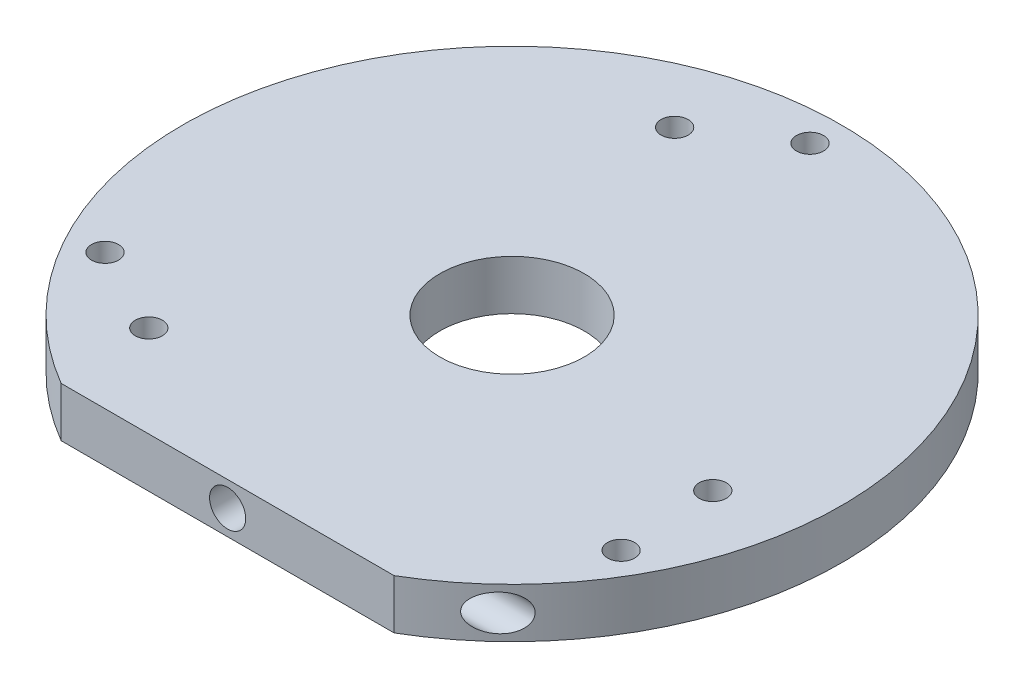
ISO-10303-21;
HEADER;
FILE_DESCRIPTION(('STEP AP214'),'2;1');
FILE_NAME('part.step','',(''),(''),'','','');
FILE_SCHEMA(('AUTOMOTIVE_DESIGN { 1 0 10303 214 1 1 1 1 }'));
ENDSEC;
DATA;
#1=APPLICATION_CONTEXT('core data for automotive mechanical design processes');
#2=APPLICATION_PROTOCOL_DEFINITION('international standard','automotive_design',2000,#1);
#3=PRODUCT_CONTEXT('',#1,'mechanical');
#4=PRODUCT('Part','Part','',(#3));
#5=PRODUCT_RELATED_PRODUCT_CATEGORY('part','',(#4));
#6=PRODUCT_DEFINITION_FORMATION('','',#4);
#7=PRODUCT_DEFINITION_CONTEXT('part definition',#1,'design');
#8=PRODUCT_DEFINITION('design','',#6,#7);
#9=PRODUCT_DEFINITION_SHAPE('','',#8);
#10=(LENGTH_UNIT() NAMED_UNIT(*) SI_UNIT(.MILLI.,.METRE.));
#11=(NAMED_UNIT(*) PLANE_ANGLE_UNIT() SI_UNIT($,.RADIAN.));
#12=(NAMED_UNIT(*) SI_UNIT($,.STERADIAN.) SOLID_ANGLE_UNIT());
#13=UNCERTAINTY_MEASURE_WITH_UNIT(LENGTH_MEASURE(1.E-05),#10,'distance_accuracy_value','');
#14=(GEOMETRIC_REPRESENTATION_CONTEXT(3) GLOBAL_UNCERTAINTY_ASSIGNED_CONTEXT((#13)) GLOBAL_UNIT_ASSIGNED_CONTEXT((#10,
#11,#12)) REPRESENTATION_CONTEXT('',''));
#15=CARTESIAN_POINT('',(0.,0.,0.));
#16=DIRECTION('',(0.,0.,1.));
#17=DIRECTION('',(1.,0.,0.));
#18=AXIS2_PLACEMENT_3D('',#15,#16,#17);
#19=CARTESIAN_POINT('',(36.501,-4.74999999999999,26.5));
#20=DIRECTION('',(-1.,0.,0.));
#21=DIRECTION('',(0.,0.,1.));
#22=AXIS2_PLACEMENT_3D('',#19,#20,#21);
#23=CYLINDRICAL_SURFACE('',#22,2.);
#24=CARTESIAN_POINT('',(22.8035085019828,-4.74999999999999,28.5));
#25=CARTESIAN_POINT('',(22.8035194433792,-4.66614474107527,28.4999917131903));
#26=CARTESIAN_POINT('',(22.8101869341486,-4.58214146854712,28.4946603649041));
#27=CARTESIAN_POINT('',(22.836100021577,-4.41730327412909,28.4738966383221));
#28=CARTESIAN_POINT('',(22.8553814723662,-4.33647808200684,28.4584354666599));
#29=CARTESIAN_POINT('',(22.9042916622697,-4.1812608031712,28.4190848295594));
#30=CARTESIAN_POINT('',(22.9338120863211,-4.10681116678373,28.3952835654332));
#31=CARTESIAN_POINT('',(23.0010219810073,-3.96449597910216,28.3408690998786));
#32=CARTESIAN_POINT('',(23.0387126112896,-3.89663136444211,28.3102549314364));
#33=CARTESIAN_POINT('',(23.1425383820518,-3.73255945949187,28.2255110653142));
#34=CARTESIAN_POINT('',(23.2129906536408,-3.64102699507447,28.1676508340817));
#35=CARTESIAN_POINT('',(23.3634974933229,-3.47316212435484,28.0429420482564));
#36=CARTESIAN_POINT('',(23.443578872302,-3.3968738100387,27.9760683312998));
#37=CARTESIAN_POINT('',(23.5892914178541,-3.27545746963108,27.8532234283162));
#38=CARTESIAN_POINT('',(23.6536059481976,-3.22728716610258,27.798639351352));
#39=CARTESIAN_POINT('',(23.784763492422,-3.13837657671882,27.6865037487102));
#40=CARTESIAN_POINT('',(23.8516077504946,-3.09764000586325,27.6289507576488));
#41=CARTESIAN_POINT('',(24.0548205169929,-2.98595285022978,27.4526435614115));
#42=CARTESIAN_POINT('',(24.1938826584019,-2.92551392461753,27.3302296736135));
#43=CARTESIAN_POINT('',(24.4802446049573,-2.82909849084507,27.0740844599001));
#44=CARTESIAN_POINT('',(24.627655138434,-2.79415684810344,26.9400986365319));
#45=CARTESIAN_POINT('',(24.9223768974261,-2.75228770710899,26.6676836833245));
#46=CARTESIAN_POINT('',(25.0696881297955,-2.74535802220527,26.5292549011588));
#47=CARTESIAN_POINT('',(25.3613275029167,-2.76070477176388,26.2505960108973));
#48=CARTESIAN_POINT('',(25.5056535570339,-2.78300097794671,26.1103647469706));
#49=CARTESIAN_POINT('',(25.7877267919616,-2.85940936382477,25.8318062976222));
#50=CARTESIAN_POINT('',(25.9254811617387,-2.91348587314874,25.6934771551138));
#51=CARTESIAN_POINT('',(26.1515970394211,-3.03641799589,25.462956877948));
#52=CARTESIAN_POINT('',(26.2427926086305,-3.09658550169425,25.3689125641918));
#53=CARTESIAN_POINT('',(26.4167638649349,-3.23641911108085,25.1877003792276));
#54=CARTESIAN_POINT('',(26.4995516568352,-3.31605660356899,25.1005226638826));
#55=CARTESIAN_POINT('',(26.6355340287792,-3.47522142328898,24.9560782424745));
#56=CARTESIAN_POINT('',(26.6911622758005,-3.55059027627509,24.8965356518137));
#57=CARTESIAN_POINT('',(26.7931403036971,-3.71346703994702,24.7867550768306));
#58=CARTESIAN_POINT('',(26.8395013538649,-3.80095998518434,24.7365057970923));
#59=CARTESIAN_POINT('',(26.9134018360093,-3.9708233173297,24.656059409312));
#60=CARTESIAN_POINT('',(26.9428120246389,-4.05144151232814,24.6238951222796));
#61=CARTESIAN_POINT('',(26.9921293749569,-4.21882955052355,24.5698249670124));
#62=CARTESIAN_POINT('',(27.0120416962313,-4.30559602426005,24.5479135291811));
#63=CARTESIAN_POINT('',(27.0412231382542,-4.48350719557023,24.5157651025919));
#64=CARTESIAN_POINT('',(27.0504384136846,-4.57467165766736,24.5055871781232));
#65=CARTESIAN_POINT('',(27.057386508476,-4.75796714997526,24.4979155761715));
#66=CARTESIAN_POINT('',(27.055122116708,-4.85009793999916,24.5004188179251));
#67=CARTESIAN_POINT('',(27.0399634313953,-5.02443145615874,24.5171466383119));
#68=CARTESIAN_POINT('',(27.0279828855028,-5.10681559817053,24.5303636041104));
#69=CARTESIAN_POINT('',(26.9952458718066,-5.26761622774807,24.5663853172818));
#70=CARTESIAN_POINT('',(26.9744886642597,-5.34603238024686,24.5891908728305));
#71=CARTESIAN_POINT('',(26.9241028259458,-5.50074948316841,24.6443529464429));
#72=CARTESIAN_POINT('',(26.8941150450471,-5.57679386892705,24.6770951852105));
#73=CARTESIAN_POINT('',(26.8269802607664,-5.72176054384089,24.7500625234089));
#74=CARTESIAN_POINT('',(26.7898292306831,-5.79067879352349,24.7902918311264));
#75=CARTESIAN_POINT('',(26.6904944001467,-5.95192247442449,24.8972894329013));
#76=CARTESIAN_POINT('',(26.6248128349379,-6.03977326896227,24.9675749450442));
#77=CARTESIAN_POINT('',(26.483957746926,-6.1988282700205,25.116938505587));
#78=CARTESIAN_POINT('',(26.4087637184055,-6.26999553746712,25.1960355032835));
#79=CARTESIAN_POINT('',(26.2230230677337,-6.41932603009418,25.3895022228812));
#80=CARTESIAN_POINT('',(26.1095309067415,-6.49069954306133,25.5062773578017));
#81=CARTESIAN_POINT('',(25.8744931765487,-6.60664263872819,25.7446859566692));
#82=CARTESIAN_POINT('',(25.7529376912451,-6.65117851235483,25.8663253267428));
#83=CARTESIAN_POINT('',(25.4683772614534,-6.72538219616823,26.1469362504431));
#84=CARTESIAN_POINT('',(25.3036716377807,-6.74685849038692,26.3063937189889));
#85=CARTESIAN_POINT('',(25.054260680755,-6.75109382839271,26.5433116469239));
#86=CARTESIAN_POINT('',(24.9706118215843,-6.74781793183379,26.6220157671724));
#87=CARTESIAN_POINT('',(24.8030436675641,-6.73210996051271,26.7782016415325));
#88=CARTESIAN_POINT('',(24.7191245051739,-6.71968184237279,26.8556839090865));
#89=CARTESIAN_POINT('',(24.5506433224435,-6.68556392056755,27.0097965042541));
#90=CARTESIAN_POINT('',(24.4660845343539,-6.66377263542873,27.0864077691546));
#91=CARTESIAN_POINT('',(24.2978650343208,-6.61081415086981,27.2374104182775));
#92=CARTESIAN_POINT('',(24.2142045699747,-6.57964443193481,27.3118012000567));
#93=CARTESIAN_POINT('',(24.0487721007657,-6.50773501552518,27.4575796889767));
#94=CARTESIAN_POINT('',(23.9669959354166,-6.46701918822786,27.5289743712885));
#95=CARTESIAN_POINT('',(23.8061573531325,-6.37551184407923,27.6681797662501));
#96=CARTESIAN_POINT('',(23.7270928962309,-6.32472810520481,27.7359931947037));
#97=CARTESIAN_POINT('',(23.5660096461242,-6.20728499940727,27.8730216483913));
#98=CARTESIAN_POINT('',(23.4843634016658,-6.13960936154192,27.9418154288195));
#99=CARTESIAN_POINT('',(23.3284027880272,-5.99021576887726,28.0721553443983));
#100=CARTESIAN_POINT('',(23.2540791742,-5.90851588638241,28.1337106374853));
#101=CARTESIAN_POINT('',(23.1324306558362,-5.7503510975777,28.2337631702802));
#102=CARTESIAN_POINT('',(23.0828195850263,-5.67696692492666,28.2743134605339));
#103=CARTESIAN_POINT('',(22.9929649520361,-5.52096081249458,28.3474321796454));
#104=CARTESIAN_POINT('',(22.9527095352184,-5.43835076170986,28.3800107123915));
#105=CARTESIAN_POINT('',(22.8923772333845,-5.28403428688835,28.4286867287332));
#106=CARTESIAN_POINT('',(22.8698066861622,-5.21395637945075,28.4468356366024));
#107=CARTESIAN_POINT('',(22.8340060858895,-5.07003923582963,28.4755808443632));
#108=CARTESIAN_POINT('',(22.8207512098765,-4.99621056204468,28.4861972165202));
#109=CARTESIAN_POINT('',(22.8096595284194,-4.89312844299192,28.4950775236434));
#110=CARTESIAN_POINT('',(22.807358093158,-4.86459020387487,28.4969195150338));
#111=CARTESIAN_POINT('',(22.8042805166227,-4.80737377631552,28.4993823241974));
#112=CARTESIAN_POINT('',(22.8035047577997,-4.77869555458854,28.5000028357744));
#113=CARTESIAN_POINT('',(22.8035085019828,-4.74999999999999,28.5));
#114=B_SPLINE_CURVE_WITH_KNOTS('',3,(#24,#25,#26,#27,#28,#29,#30,#31,#32,#33,#34,#35,#36,#37,
#38,#39,#40,#41,#42,#43,#44,#45,#46,#47,#48,#49,#50,#51,#52,#53,#54,#55,#56,#57,#58,#59,#60,#61,
#62,#63,#64,#65,#66,#67,#68,#69,#70,#71,#72,#73,#74,#75,#76,#77,#78,#79,#80,#81,#82,#83,#84,#85,
#86,#87,#88,#89,#90,#91,#92,#93,#94,#95,#96,#97,#98,#99,#100,#101,#102,#103,#104,#105,#106,#107,
#108,#109,#110,#111,#112,#113),.UNSPECIFIED.,.T.,.F.,(4,2,2,2,2,2,2,2,2,2,2,2,2,2,2,2,2,2,2,2,2,
2,2,2,2,2,2,2,2,2,2,2,2,2,2,2,2,2,2,2,2,2,2,2,4),(0.,0.251419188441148,0.503556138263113,
0.753103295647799,1.0026858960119,1.3880944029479,1.77460201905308,2.06563988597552,
2.35682280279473,2.93912672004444,3.54391885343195,4.14866377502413,4.75381802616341,
5.35829434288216,5.78938786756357,6.21985166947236,6.55165131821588,6.88304499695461,
7.15684714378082,7.43050038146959,7.7055252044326,7.98048321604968,8.23222343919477,
8.48398488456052,8.74714645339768,9.01045638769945,9.39910954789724,9.78861526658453,
10.3190888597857,10.850227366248,11.537142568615,11.881574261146,12.2258571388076,
12.573969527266,12.922175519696,13.2695199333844,13.6165970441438,13.9948499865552,
14.3726191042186,14.6639364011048,14.9548825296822,15.1814902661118,15.4074918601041,
15.4935068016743,15.5795433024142),.UNSPECIFIED.);
#115=CARTESIAN_POINT('',(22.8035085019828,-4.74999999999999,28.5));
#116=VERTEX_POINT('',#115);
#117=EDGE_CURVE('E97',#116,#116,#114,.T.);
#118=ORIENTED_EDGE('',*,*,#117,.F.);
#119=EDGE_LOOP('',(#118));
#120=FACE_BOUND('',#119,.T.);
#121=CARTESIAN_POINT('',(0.000911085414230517,-4.75,26.5));
#122=DIRECTION('',(-0.707106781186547,0.,-0.707106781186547));
#123=DIRECTION('',(-0.707106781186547,0.,0.707106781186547));
#124=AXIS2_PLACEMENT_3D('',#121,#122,#123);
#125=ELLIPSE('',#124,2.82842712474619,2.);
#126=CARTESIAN_POINT('',(0.000911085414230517,-2.75,26.5));
#127=VERTEX_POINT('',#126);
#128=CARTESIAN_POINT('',(0.000911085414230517,-6.75,26.5));
#129=VERTEX_POINT('',#128);
#130=EDGE_CURVE('E93',#127,#129,#125,.T.);
#131=ORIENTED_EDGE('',*,*,#130,.T.);
#132=CARTESIAN_POINT('',(0.000911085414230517,-4.75,26.5));
#133=DIRECTION('',(-0.707106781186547,0.,0.707106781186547));
#134=DIRECTION('',(-0.707106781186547,0.,-0.707106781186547));
#135=AXIS2_PLACEMENT_3D('',#132,#133,#134);
#136=ELLIPSE('',#135,2.82842712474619,2.);
#137=EDGE_CURVE('E92',#129,#127,#136,.T.);
#138=ORIENTED_EDGE('',*,*,#137,.T.);
#139=EDGE_LOOP('',(#131,#138));
#140=FACE_BOUND('',#139,.T.);
#141=ADVANCED_FACE('F41',(#120,#140),#23,.F.);
#142=CARTESIAN_POINT('',(0.,37.9568335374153,0.));
#143=DIRECTION('',(0.,1.,0.));
#144=DIRECTION('',(0.,0.,1.));
#145=AXIS2_PLACEMENT_3D('',#142,#143,#144);
#146=CYLINDRICAL_SURFACE('',#145,36.5);
#147=CARTESIAN_POINT('',(0.,-1.99999999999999,0.));
#148=DIRECTION('',(0.,1.,0.));
#149=DIRECTION('',(0.,0.,1.));
#150=AXIS2_PLACEMENT_3D('',#147,#148,#149);
#151=CIRCLE('',#150,36.5);
#152=CARTESIAN_POINT('',(18.4390889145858,-1.99999999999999,31.5));
#153=VERTEX_POINT('',#152);
#154=CARTESIAN_POINT('',(-18.4390889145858,-1.99999999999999,31.5));
#155=VERTEX_POINT('',#154);
#156=EDGE_CURVE('E230',#153,#155,#151,.T.);
#157=ORIENTED_EDGE('',*,*,#156,.F.);
#158=DIRECTION('',(0.,1.,0.));
#159=VECTOR('',#158,1.);
#160=CARTESIAN_POINT('',(18.4390889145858,37.9568335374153,31.5));
#161=LINE('',#160,#159);
#162=CARTESIAN_POINT('',(18.4390889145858,-7.5,31.5));
#163=VERTEX_POINT('',#162);
#164=EDGE_CURVE('E94',#153,#163,#161,.F.);
#165=ORIENTED_EDGE('',*,*,#164,.T.);
#166=CARTESIAN_POINT('',(0.,-7.5,0.));
#167=DIRECTION('',(0.,1.,0.));
#168=DIRECTION('',(0.,0.,1.));
#169=AXIS2_PLACEMENT_3D('',#166,#167,#168);
#170=CIRCLE('',#169,36.5);
#171=CARTESIAN_POINT('',(-18.4390889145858,-7.5,31.5));
#172=VERTEX_POINT('',#171);
#173=EDGE_CURVE('E234',#163,#172,#170,.T.);
#174=ORIENTED_EDGE('',*,*,#173,.T.);
#175=DIRECTION('',(0.,1.,0.));
#176=VECTOR('',#175,1.);
#177=CARTESIAN_POINT('',(-18.4390889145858,37.9568335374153,31.5));
#178=LINE('',#177,#176);
#179=EDGE_CURVE('E246',#172,#155,#178,.T.);
#180=ORIENTED_EDGE('',*,*,#179,.T.);
#181=EDGE_LOOP('',(#157,#165,#174,#180));
#182=FACE_BOUND('',#181,.T.);
#183=ORIENTED_EDGE('',*,*,#117,.T.);
#184=EDGE_LOOP('',(#183));
#185=FACE_BOUND('',#184,.T.);
#186=ADVANCED_FACE('F136',(#182,#185),#146,.T.);
#187=CARTESIAN_POINT('',(36.5,-2.,0.));
#188=DIRECTION('',(0.,-1.,0.));
#189=DIRECTION('',(0.,0.,-1.));
#190=AXIS2_PLACEMENT_3D('',#187,#188,#189);
#191=PLANE('',#190);
#192=CARTESIAN_POINT('',(-18.8964289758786,-2.,21.3348300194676));
#193=DIRECTION('',(0.,1.,0.));
#194=DIRECTION('',(0.,0.,1.));
#195=AXIS2_PLACEMENT_3D('',#192,#193,#194);
#196=CIRCLE('',#195,1.5);
#197=CARTESIAN_POINT('',(-18.8964289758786,-2.,22.8348300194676));
#198=VERTEX_POINT('',#197);
#199=EDGE_CURVE('E191',#198,#198,#196,.T.);
#200=ORIENTED_EDGE('',*,*,#199,.F.);
#201=EDGE_LOOP('',(#200));
#202=FACE_BOUND('',#201,.T.);
#203=CARTESIAN_POINT('',(-9.02829029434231,-2.,-27.0322025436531));
#204=DIRECTION('',(0.,1.,0.));
#205=DIRECTION('',(0.,0.,1.));
#206=AXIS2_PLACEMENT_3D('',#203,#204,#205);
#207=CIRCLE('',#206,1.5);
#208=CARTESIAN_POINT('',(-9.02829029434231,-2.,-25.5322025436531));
#209=VERTEX_POINT('',#208);
#210=EDGE_CURVE('E200',#209,#209,#207,.T.);
#211=ORIENTED_EDGE('',*,*,#210,.F.);
#212=EDGE_LOOP('',(#211));
#213=FACE_BOUND('',#212,.T.);
#214=CARTESIAN_POINT('',(27.924719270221,-2.,5.69737252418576));
#215=DIRECTION('',(0.,1.,0.));
#216=DIRECTION('',(0.,0.,1.));
#217=AXIS2_PLACEMENT_3D('',#214,#215,#216);
#218=CIRCLE('',#217,1.5);
#219=CARTESIAN_POINT('',(27.924719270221,-2.,7.19737252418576));
#220=VERTEX_POINT('',#219);
#221=EDGE_CURVE('E206',#220,#220,#218,.T.);
#222=ORIENTED_EDGE('',*,*,#221,.F.);
#223=EDGE_LOOP('',(#222));
#224=FACE_BOUND('',#223,.T.);
#225=CARTESIAN_POINT('',(0.,-2.,-33.));
#226=DIRECTION('',(0.,-1.,0.));
#227=DIRECTION('',(0.,0.,-1.));
#228=AXIS2_PLACEMENT_3D('',#225,#226,#227);
#229=CIRCLE('',#228,1.5);
#230=CARTESIAN_POINT('',(0.,-2.,-34.5));
#231=VERTEX_POINT('',#230);
#232=EDGE_CURVE('E214',#231,#231,#229,.T.);
#233=ORIENTED_EDGE('',*,*,#232,.T.);
#234=EDGE_LOOP('',(#233));
#235=FACE_BOUND('',#234,.T.);
#236=CARTESIAN_POINT('',(28.578838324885,-2.,16.5000000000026));
#237=DIRECTION('',(0.,-1.,0.));
#238=DIRECTION('',(0.,0.,-1.));
#239=AXIS2_PLACEMENT_3D('',#236,#237,#238);
#240=CIRCLE('',#239,1.49999999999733);
#241=CARTESIAN_POINT('',(28.578838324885,-2.,15.0000000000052));
#242=VERTEX_POINT('',#241);
#243=EDGE_CURVE('E218',#242,#242,#240,.T.);
#244=ORIENTED_EDGE('',*,*,#243,.T.);
#245=EDGE_LOOP('',(#244));
#246=FACE_BOUND('',#245,.T.);
#247=CARTESIAN_POINT('',(-28.5788383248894,-2.,16.4999999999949));
#248=DIRECTION('',(0.,-1.,0.));
#249=DIRECTION('',(0.,0.,-1.));
#250=AXIS2_PLACEMENT_3D('',#247,#248,#249);
#251=CIRCLE('',#250,1.49999999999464);
#252=CARTESIAN_POINT('',(-28.5788383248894,-2.,15.0000000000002));
#253=VERTEX_POINT('',#252);
#254=EDGE_CURVE('E222',#253,#253,#251,.T.);
#255=ORIENTED_EDGE('',*,*,#254,.T.);
#256=EDGE_LOOP('',(#255));
#257=FACE_BOUND('',#256,.T.);
#258=CARTESIAN_POINT('',(0.,-2.,0.));
#259=DIRECTION('',(0.,1.,0.));
#260=DIRECTION('',(0.,0.,1.));
#261=AXIS2_PLACEMENT_3D('',#258,#259,#260);
#262=CIRCLE('',#261,8.00000000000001);
#263=CARTESIAN_POINT('',(0.,-2.,8.00000000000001));
#264=VERTEX_POINT('',#263);
#265=EDGE_CURVE('E226',#264,#264,#262,.T.);
#266=ORIENTED_EDGE('',*,*,#265,.F.);
#267=EDGE_LOOP('',(#266));
#268=FACE_BOUND('',#267,.T.);
#269=ORIENTED_EDGE('',*,*,#156,.T.);
#270=DIRECTION('',(1.,0.,0.));
#271=VECTOR('',#270,1.);
#272=CARTESIAN_POINT('',(36.5,-2.,31.5));
#273=LINE('',#272,#271);
#274=EDGE_CURVE('E231',#155,#153,#273,.T.);
#275=ORIENTED_EDGE('',*,*,#274,.T.);
#276=EDGE_LOOP('',(#269,#275));
#277=FACE_BOUND('',#276,.T.);
#278=ADVANCED_FACE('F43',(#202,#213,#224,#235,#246,#257,#268,#277),#191,.F.);
#279=CARTESIAN_POINT('',(0.,37.9568335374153,0.));
#280=DIRECTION('',(0.,1.,0.));
#281=DIRECTION('',(0.,0.,1.));
#282=AXIS2_PLACEMENT_3D('',#279,#280,#281);
#283=CYLINDRICAL_SURFACE('',#282,8.00000000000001);
#284=CARTESIAN_POINT('',(0.,-7.5,0.));
#285=DIRECTION('',(0.,1.,0.));
#286=DIRECTION('',(0.,0.,1.));
#287=AXIS2_PLACEMENT_3D('',#284,#285,#286);
#288=CIRCLE('',#287,8.00000000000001);
#289=CARTESIAN_POINT('',(0.,-7.5,8.00000000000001));
#290=VERTEX_POINT('',#289);
#291=EDGE_CURVE('E237',#290,#290,#288,.T.);
#292=ORIENTED_EDGE('',*,*,#291,.F.);
#293=EDGE_LOOP('',(#292));
#294=FACE_BOUND('',#293,.T.);
#295=ORIENTED_EDGE('',*,*,#265,.T.);
#296=EDGE_LOOP('',(#295));
#297=FACE_BOUND('',#296,.T.);
#298=ADVANCED_FACE('F141',(#294,#297),#283,.F.);
#299=CARTESIAN_POINT('',(36.5,-7.5,0.));
#300=DIRECTION('',(0.,1.,0.));
#301=DIRECTION('',(0.,0.,1.));
#302=AXIS2_PLACEMENT_3D('',#299,#300,#301);
#303=PLANE('',#302);
#304=CARTESIAN_POINT('',(-18.8964289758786,-7.5,21.3348300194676));
#305=DIRECTION('',(0.,1.,0.));
#306=DIRECTION('',(0.,0.,1.));
#307=AXIS2_PLACEMENT_3D('',#304,#305,#306);
#308=CIRCLE('',#307,1.5);
#309=CARTESIAN_POINT('',(-18.8964289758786,-7.5,22.8348300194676));
#310=VERTEX_POINT('',#309);
#311=EDGE_CURVE('E189',#310,#310,#308,.T.);
#312=ORIENTED_EDGE('',*,*,#311,.T.);
#313=EDGE_LOOP('',(#312));
#314=FACE_BOUND('',#313,.T.);
#315=CARTESIAN_POINT('',(-9.02829029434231,-7.5,-27.0322025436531));
#316=DIRECTION('',(0.,1.,0.));
#317=DIRECTION('',(0.,0.,1.));
#318=AXIS2_PLACEMENT_3D('',#315,#316,#317);
#319=CIRCLE('',#318,1.5);
#320=CARTESIAN_POINT('',(-9.02829029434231,-7.5,-25.5322025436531));
#321=VERTEX_POINT('',#320);
#322=EDGE_CURVE('E195',#321,#321,#319,.T.);
#323=ORIENTED_EDGE('',*,*,#322,.T.);
#324=EDGE_LOOP('',(#323));
#325=FACE_BOUND('',#324,.T.);
#326=CARTESIAN_POINT('',(27.924719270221,-7.5,5.69737252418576));
#327=DIRECTION('',(0.,1.,0.));
#328=DIRECTION('',(0.,0.,1.));
#329=AXIS2_PLACEMENT_3D('',#326,#327,#328);
#330=CIRCLE('',#329,1.5);
#331=CARTESIAN_POINT('',(27.924719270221,-7.5,7.19737252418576));
#332=VERTEX_POINT('',#331);
#333=EDGE_CURVE('E203',#332,#332,#330,.T.);
#334=ORIENTED_EDGE('',*,*,#333,.T.);
#335=EDGE_LOOP('',(#334));
#336=FACE_BOUND('',#335,.T.);
#337=CARTESIAN_POINT('',(0.,-7.5,-33.));
#338=DIRECTION('',(0.,1.,0.));
#339=DIRECTION('',(0.,0.,1.));
#340=AXIS2_PLACEMENT_3D('',#337,#338,#339);
#341=CIRCLE('',#340,1.5);
#342=CARTESIAN_POINT('',(0.,-7.5,-31.5));
#343=VERTEX_POINT('',#342);
#344=EDGE_CURVE('E112',#343,#343,#341,.T.);
#345=ORIENTED_EDGE('',*,*,#344,.T.);
#346=EDGE_LOOP('',(#345));
#347=FACE_BOUND('',#346,.T.);
#348=CARTESIAN_POINT('',(28.578838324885,-7.5,16.5000000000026));
#349=DIRECTION('',(0.,1.,0.));
#350=DIRECTION('',(0.,0.,1.));
#351=AXIS2_PLACEMENT_3D('',#348,#349,#350);
#352=CIRCLE('',#351,1.49999999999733);
#353=CARTESIAN_POINT('',(28.578838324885,-7.5,17.9999999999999));
#354=VERTEX_POINT('',#353);
#355=EDGE_CURVE('E261',#354,#354,#352,.T.);
#356=ORIENTED_EDGE('',*,*,#355,.T.);
#357=EDGE_LOOP('',(#356));
#358=FACE_BOUND('',#357,.T.);
#359=CARTESIAN_POINT('',(-28.5788383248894,-7.5,16.4999999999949));
#360=DIRECTION('',(0.,1.,0.));
#361=DIRECTION('',(0.,0.,1.));
#362=AXIS2_PLACEMENT_3D('',#359,#360,#361);
#363=CIRCLE('',#362,1.49999999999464);
#364=CARTESIAN_POINT('',(-28.5788383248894,-7.5,17.9999999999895));
#365=VERTEX_POINT('',#364);
#366=EDGE_CURVE('E99',#365,#365,#363,.T.);
#367=ORIENTED_EDGE('',*,*,#366,.T.);
#368=EDGE_LOOP('',(#367));
#369=FACE_BOUND('',#368,.T.);
#370=ORIENTED_EDGE('',*,*,#173,.F.);
#371=DIRECTION('',(-1.,0.,0.));
#372=VECTOR('',#371,1.);
#373=CARTESIAN_POINT('',(36.5,-7.5,31.5));
#374=LINE('',#373,#372);
#375=EDGE_CURVE('E239',#163,#172,#374,.T.);
#376=ORIENTED_EDGE('',*,*,#375,.T.);
#377=EDGE_LOOP('',(#370,#376));
#378=FACE_BOUND('',#377,.T.);
#379=ORIENTED_EDGE('',*,*,#291,.T.);
#380=EDGE_LOOP('',(#379));
#381=FACE_BOUND('',#380,.T.);
#382=ADVANCED_FACE('F134',(#314,#325,#336,#347,#358,#369,#378,#381),#303,.F.);
#383=CARTESIAN_POINT('',(-18.4390889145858,-8.,31.5));
#384=DIRECTION('',(0.,0.,-1.));
#385=DIRECTION('',(-1.,0.,0.));
#386=AXIS2_PLACEMENT_3D('',#383,#384,#385);
#387=PLANE('',#386);
#388=CARTESIAN_POINT('',(0.000911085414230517,-4.75,31.5));
#389=DIRECTION('',(0.,0.,-1.));
#390=DIRECTION('',(-1.,0.,0.));
#391=AXIS2_PLACEMENT_3D('',#388,#389,#390);
#392=CIRCLE('',#391,2.);
#393=CARTESIAN_POINT('',(-1.99908891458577,-4.75,31.5));
#394=VERTEX_POINT('',#393);
#395=EDGE_CURVE('E104',#394,#394,#392,.T.);
#396=ORIENTED_EDGE('',*,*,#395,.T.);
#397=EDGE_LOOP('',(#396));
#398=FACE_BOUND('',#397,.T.);
#399=ORIENTED_EDGE('',*,*,#179,.F.);
#400=ORIENTED_EDGE('',*,*,#375,.F.);
#401=ORIENTED_EDGE('',*,*,#164,.F.);
#402=ORIENTED_EDGE('',*,*,#274,.F.);
#403=EDGE_LOOP('',(#399,#400,#401,#402));
#404=FACE_BOUND('',#403,.T.);
#405=ADVANCED_FACE('F130',(#398,#404),#387,.F.);
#406=CARTESIAN_POINT('',(-28.5788383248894,-7.5,16.4999999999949));
#407=DIRECTION('',(0.,1.,0.));
#408=DIRECTION('',(0.,0.,1.));
#409=AXIS2_PLACEMENT_3D('',#406,#407,#408);
#410=CYLINDRICAL_SURFACE('',#409,1.49999999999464);
#411=ORIENTED_EDGE('',*,*,#366,.F.);
#412=EDGE_LOOP('',(#411));
#413=FACE_BOUND('',#412,.T.);
#414=ORIENTED_EDGE('',*,*,#254,.F.);
#415=EDGE_LOOP('',(#414));
#416=FACE_BOUND('',#415,.T.);
#417=ADVANCED_FACE('F126',(#413,#416),#410,.F.);
#418=CARTESIAN_POINT('',(28.578838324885,-7.5,16.5000000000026));
#419=DIRECTION('',(0.,1.,0.));
#420=DIRECTION('',(0.,0.,1.));
#421=AXIS2_PLACEMENT_3D('',#418,#419,#420);
#422=CYLINDRICAL_SURFACE('',#421,1.49999999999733);
#423=ORIENTED_EDGE('',*,*,#355,.F.);
#424=EDGE_LOOP('',(#423));
#425=FACE_BOUND('',#424,.T.);
#426=ORIENTED_EDGE('',*,*,#243,.F.);
#427=EDGE_LOOP('',(#426));
#428=FACE_BOUND('',#427,.T.);
#429=ADVANCED_FACE('F122',(#425,#428),#422,.F.);
#430=CARTESIAN_POINT('',(0.,-7.5,-33.));
#431=DIRECTION('',(0.,1.,0.));
#432=DIRECTION('',(0.,0.,1.));
#433=AXIS2_PLACEMENT_3D('',#430,#431,#432);
#434=CYLINDRICAL_SURFACE('',#433,1.5);
#435=ORIENTED_EDGE('',*,*,#344,.F.);
#436=EDGE_LOOP('',(#435));
#437=FACE_BOUND('',#436,.T.);
#438=ORIENTED_EDGE('',*,*,#232,.F.);
#439=EDGE_LOOP('',(#438));
#440=FACE_BOUND('',#439,.T.);
#441=ADVANCED_FACE('F119',(#437,#440),#434,.F.);
#442=CARTESIAN_POINT('',(0.000911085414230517,-4.75,21.5));
#443=DIRECTION('',(0.,0.,1.));
#444=DIRECTION('',(1.,0.,0.));
#445=AXIS2_PLACEMENT_3D('',#442,#443,#444);
#446=CYLINDRICAL_SURFACE('',#445,2.);
#447=CARTESIAN_POINT('',(0.000911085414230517,-4.75,21.5));
#448=DIRECTION('',(0.,0.,-1.));
#449=DIRECTION('',(-1.,0.,0.));
#450=AXIS2_PLACEMENT_3D('',#447,#448,#449);
#451=CIRCLE('',#450,2.);
#452=CARTESIAN_POINT('',(-1.99908891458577,-4.75,21.5));
#453=VERTEX_POINT('',#452);
#454=EDGE_CURVE('E101',#453,#453,#451,.T.);
#455=ORIENTED_EDGE('',*,*,#454,.T.);
#456=EDGE_LOOP('',(#455));
#457=FACE_BOUND('',#456,.T.);
#458=ORIENTED_EDGE('',*,*,#395,.F.);
#459=EDGE_LOOP('',(#458));
#460=FACE_BOUND('',#459,.T.);
#461=CARTESIAN_POINT('',(0.,-4.74999999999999,26.5));
#462=DIRECTION('',(1.,0.,0.));
#463=DIRECTION('',(0.,0.,-1.));
#464=AXIS2_PLACEMENT_3D('',#461,#462,#463);
#465=CIRCLE('',#464,2.);
#466=CARTESIAN_POINT('',(0.,-6.74999979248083,26.5009110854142));
#467=VERTEX_POINT('',#466);
#468=CARTESIAN_POINT('',(0.,-6.74999979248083,26.4990889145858));
#469=VERTEX_POINT('',#468);
#470=EDGE_CURVE('E90',#467,#469,#465,.T.);
#471=ORIENTED_EDGE('',*,*,#470,.T.);
#472=CARTESIAN_POINT('',(0.000911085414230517,-4.75,26.5));
#473=DIRECTION('',(-0.707106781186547,0.,0.707106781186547));
#474=DIRECTION('',(-0.707106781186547,0.,-0.707106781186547));
#475=AXIS2_PLACEMENT_3D('',#472,#473,#474);
#476=ELLIPSE('',#475,2.82842712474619,2.);
#477=EDGE_CURVE('E45',#129,#469,#476,.F.);
#478=ORIENTED_EDGE('',*,*,#477,.F.);
#479=ORIENTED_EDGE('',*,*,#130,.F.);
#480=CARTESIAN_POINT('',(0.,-2.75000020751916,26.4990889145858));
#481=VERTEX_POINT('',#480);
#482=EDGE_CURVE('E11',#481,#127,#476,.F.);
#483=ORIENTED_EDGE('',*,*,#482,.F.);
#484=CARTESIAN_POINT('',(0.,-2.75000020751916,26.5009110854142));
#485=VERTEX_POINT('',#484);
#486=EDGE_CURVE('E65',#481,#485,#465,.T.);
#487=ORIENTED_EDGE('',*,*,#486,.T.);
#488=CARTESIAN_POINT('',(0.000911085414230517,-4.75,26.5));
#489=DIRECTION('',(-0.707106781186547,0.,-0.707106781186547));
#490=DIRECTION('',(-0.707106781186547,0.,0.707106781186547));
#491=AXIS2_PLACEMENT_3D('',#488,#489,#490);
#492=ELLIPSE('',#491,2.82842712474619,2.);
#493=EDGE_CURVE('E50',#127,#485,#492,.F.);
#494=ORIENTED_EDGE('',*,*,#493,.F.);
#495=ORIENTED_EDGE('',*,*,#137,.F.);
#496=EDGE_CURVE('E57',#467,#129,#492,.F.);
#497=ORIENTED_EDGE('',*,*,#496,.F.);
#498=EDGE_LOOP('',(#471,#478,#479,#483,#487,#494,#495,#497));
#499=FACE_BOUND('',#498,.T.);
#500=ADVANCED_FACE('F88',(#457,#460,#499),#446,.F.);
#501=CARTESIAN_POINT('',(0.000911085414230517,-4.75,21.5));
#502=DIRECTION('',(0.,0.,-1.));
#503=DIRECTION('',(-1.,0.,0.));
#504=AXIS2_PLACEMENT_3D('',#501,#502,#503);
#505=PLANE('',#504);
#506=ORIENTED_EDGE('',*,*,#454,.F.);
#507=EDGE_LOOP('',(#506));
#508=FACE_BOUND('',#507,.T.);
#509=ADVANCED_FACE('F158',(#508),#505,.F.);
#510=ORIENTED_EDGE('',*,*,#486,.F.);
#511=ORIENTED_EDGE('',*,*,#482,.T.);
#512=ORIENTED_EDGE('',*,*,#493,.T.);
#513=EDGE_LOOP('',(#510,#511,#512));
#514=FACE_BOUND('',#513,.T.);
#515=ADVANCED_FACE('F114',(#514),#23,.F.);
#516=ORIENTED_EDGE('',*,*,#496,.T.);
#517=ORIENTED_EDGE('',*,*,#477,.T.);
#518=ORIENTED_EDGE('',*,*,#470,.F.);
#519=EDGE_LOOP('',(#516,#517,#518));
#520=FACE_BOUND('',#519,.T.);
#521=ADVANCED_FACE('F96',(#520),#23,.F.);
#522=CARTESIAN_POINT('',(27.924719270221,-7.5,5.69737252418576));
#523=DIRECTION('',(0.,1.,0.));
#524=DIRECTION('',(0.,0.,1.));
#525=AXIS2_PLACEMENT_3D('',#522,#523,#524);
#526=CYLINDRICAL_SURFACE('',#525,1.5);
#527=ORIENTED_EDGE('',*,*,#333,.F.);
#528=EDGE_LOOP('',(#527));
#529=FACE_BOUND('',#528,.T.);
#530=ORIENTED_EDGE('',*,*,#221,.T.);
#531=EDGE_LOOP('',(#530));
#532=FACE_BOUND('',#531,.T.);
#533=ADVANCED_FACE('F161',(#529,#532),#526,.F.);
#534=CARTESIAN_POINT('',(-9.02829029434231,-7.5,-27.0322025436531));
#535=DIRECTION('',(0.,1.,0.));
#536=DIRECTION('',(0.,0.,1.));
#537=AXIS2_PLACEMENT_3D('',#534,#535,#536);
#538=CYLINDRICAL_SURFACE('',#537,1.5);
#539=ORIENTED_EDGE('',*,*,#322,.F.);
#540=EDGE_LOOP('',(#539));
#541=FACE_BOUND('',#540,.T.);
#542=ORIENTED_EDGE('',*,*,#210,.T.);
#543=EDGE_LOOP('',(#542));
#544=FACE_BOUND('',#543,.T.);
#545=ADVANCED_FACE('F165',(#541,#544),#538,.F.);
#546=CARTESIAN_POINT('',(-18.8964289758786,-7.5,21.3348300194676));
#547=DIRECTION('',(0.,1.,0.));
#548=DIRECTION('',(0.,0.,1.));
#549=AXIS2_PLACEMENT_3D('',#546,#547,#548);
#550=CYLINDRICAL_SURFACE('',#549,1.5);
#551=ORIENTED_EDGE('',*,*,#311,.F.);
#552=EDGE_LOOP('',(#551));
#553=FACE_BOUND('',#552,.T.);
#554=ORIENTED_EDGE('',*,*,#199,.T.);
#555=EDGE_LOOP('',(#554));
#556=FACE_BOUND('',#555,.T.);
#557=ADVANCED_FACE('F171',(#553,#556),#550,.F.);
#558=CLOSED_SHELL('',(#141,#186,#278,#298,#382,#405,#417,#429,#441,#500,#509,#515,#521,#533,
#545,#557));
#559=MANIFOLD_SOLID_BREP('B2',#558);
#560=ADVANCED_BREP_SHAPE_REPRESENTATION('',(#18,#559),#14);
#561=SHAPE_DEFINITION_REPRESENTATION(#9,#560);
ENDSEC;
END-ISO-10303-21;
